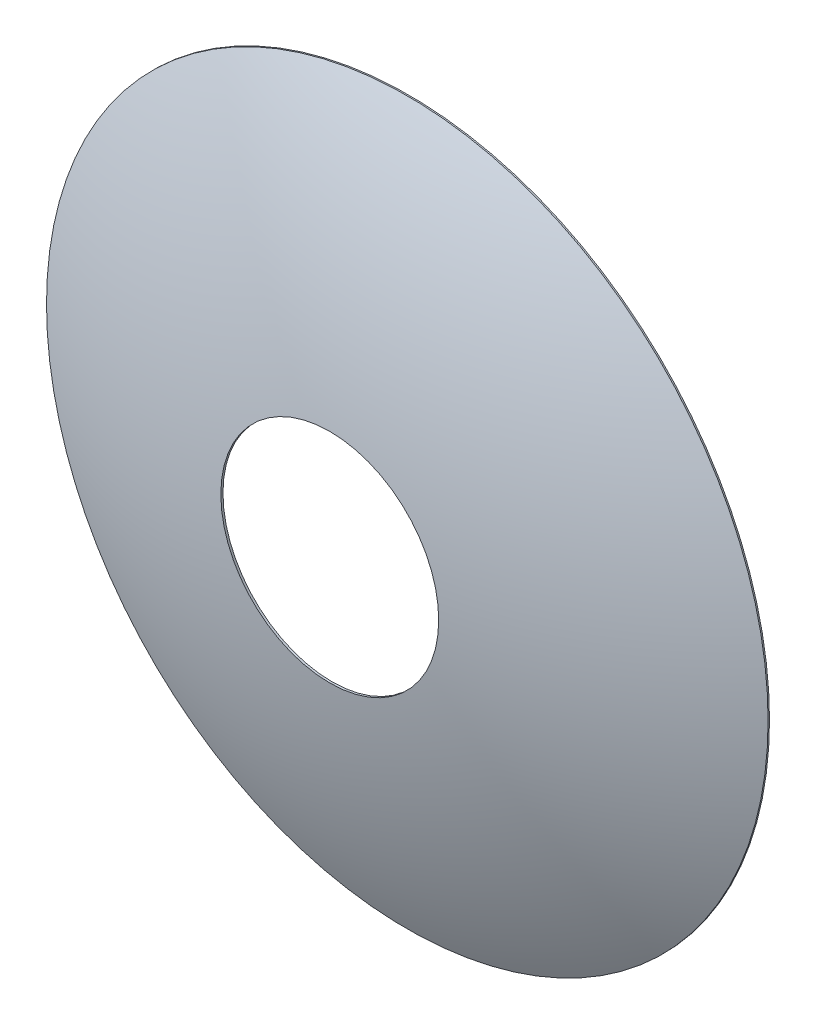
ISO-10303-21;
HEADER;
FILE_DESCRIPTION(('STEP AP214'),'2;1');
FILE_NAME('part.step','',(''),(''),'','','');
FILE_SCHEMA(('AUTOMOTIVE_DESIGN { 1 0 10303 214 1 1 1 1 }'));
ENDSEC;
DATA;
#1=APPLICATION_CONTEXT('core data for automotive mechanical design processes');
#2=APPLICATION_PROTOCOL_DEFINITION('international standard','automotive_design',2000,#1);
#3=PRODUCT_CONTEXT('',#1,'mechanical');
#4=PRODUCT('Part','Part','',(#3));
#5=PRODUCT_RELATED_PRODUCT_CATEGORY('part','',(#4));
#6=PRODUCT_DEFINITION_FORMATION('','',#4);
#7=PRODUCT_DEFINITION_CONTEXT('part definition',#1,'design');
#8=PRODUCT_DEFINITION('design','',#6,#7);
#9=PRODUCT_DEFINITION_SHAPE('','',#8);
#10=(LENGTH_UNIT() NAMED_UNIT(*) SI_UNIT(.MILLI.,.METRE.));
#11=(NAMED_UNIT(*) PLANE_ANGLE_UNIT() SI_UNIT($,.RADIAN.));
#12=(NAMED_UNIT(*) SI_UNIT($,.STERADIAN.) SOLID_ANGLE_UNIT());
#13=UNCERTAINTY_MEASURE_WITH_UNIT(LENGTH_MEASURE(1.E-05),#10,'distance_accuracy_value','');
#14=(GEOMETRIC_REPRESENTATION_CONTEXT(3) GLOBAL_UNCERTAINTY_ASSIGNED_CONTEXT((#13)) GLOBAL_UNIT_ASSIGNED_CONTEXT((#10,
#11,#12)) REPRESENTATION_CONTEXT('',''));
#15=CARTESIAN_POINT('',(0.,0.,0.));
#16=DIRECTION('',(0.,0.,1.));
#17=DIRECTION('',(1.,0.,0.));
#18=AXIS2_PLACEMENT_3D('',#15,#16,#17);
#19=CARTESIAN_POINT('',(0.,0.,-1023.75));
#20=DIRECTION('',(0.,0.,1.));
#21=DIRECTION('',(1.,0.,0.));
#22=AXIS2_PLACEMENT_3D('',#19,#20,#21);
#23=SPHERICAL_SURFACE('',#22,1143.75);
#24=CARTESIAN_POINT('',(0.,0.,0.));
#25=DIRECTION('',(0.,0.,1.));
#26=DIRECTION('',(1.,0.,0.));
#27=AXIS2_PLACEMENT_3D('',#24,#25,#26);
#28=CIRCLE('',#27,510.);
#29=CARTESIAN_POINT('',(510.,0.,0.));
#30=VERTEX_POINT('',#29);
#31=EDGE_CURVE('E43',#30,#30,#28,.T.);
#32=CARTESIAN_POINT('',(0.,0.,109.58492953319));
#33=DIRECTION('',(0.,0.,-1.));
#34=DIRECTION('',(-1.,0.,0.));
#35=AXIS2_PLACEMENT_3D('',#32,#33,#34);
#36=CIRCLE('',#35,154.);
#37=CARTESIAN_POINT('',(154.,0.,109.58492953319));
#38=VERTEX_POINT('',#37);
#39=EDGE_CURVE('E55',#38,#38,#36,.T.);
#40=CARTESIAN_POINT('',(510.,0.,0.));
#41=CARTESIAN_POINT('',(506.511504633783,0.,1.73785933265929));
#42=CARTESIAN_POINT('',(503.014125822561,0.,3.45788642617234));
#43=CARTESIAN_POINT('',(496.00196822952,0.,6.86209934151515));
#44=CARTESIAN_POINT('',(492.487189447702,0.,8.54628516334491));
#45=CARTESIAN_POINT('',(485.440598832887,0.,11.8786387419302));
#46=CARTESIAN_POINT('',(481.908786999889,0.,13.5268064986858));
#47=CARTESIAN_POINT('',(474.828499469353,0.,16.7869519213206));
#48=CARTESIAN_POINT('',(471.280023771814,0.,18.3989295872));
#49=CARTESIAN_POINT('',(464.166779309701,0.,21.5865263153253));
#50=CARTESIAN_POINT('',(460.602010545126,0.,23.1621453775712));
#51=CARTESIAN_POINT('',(453.456552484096,0.,26.2768602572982));
#52=CARTESIAN_POINT('',(449.87586318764,0.,27.8159560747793));
#53=CARTESIAN_POINT('',(442.698938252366,0.,30.8574636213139));
#54=CARTESIAN_POINT('',(439.102702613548,0.,32.3598753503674));
#55=CARTESIAN_POINT('',(431.895060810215,0.,35.3278577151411));
#56=CARTESIAN_POINT('',(428.283654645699,0.,36.7934283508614));
#57=CARTESIAN_POINT('',(421.046049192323,0.,39.6875753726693));
#58=CARTESIAN_POINT('',(417.419849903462,0.,41.1161517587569));
#59=CARTESIAN_POINT('',(410.153037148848,0.,43.9361609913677));
#60=CARTESIAN_POINT('',(406.512423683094,0.,45.3275938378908));
#61=CARTESIAN_POINT('',(399.217163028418,0.,48.0731705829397));
#62=CARTESIAN_POINT('',(395.562515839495,0.,49.4273144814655));
#63=CARTESIAN_POINT('',(388.23956965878,0.,52.0981718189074));
#64=CARTESIAN_POINT('',(384.571270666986,0.,53.4148852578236));
#65=CARTESIAN_POINT('',(377.221404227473,0.,56.010744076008));
#66=CARTESIAN_POINT('',(373.539836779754,0.,57.2898894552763));
#67=CARTESIAN_POINT('',(366.163818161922,0.,59.810478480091));
#68=CARTESIAN_POINT('',(362.469366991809,0.,61.0519221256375));
#69=CARTESIAN_POINT('',(355.067967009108,0.,63.4969779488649));
#70=CARTESIAN_POINT('',(351.36101819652,0.,64.7005901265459));
#71=CARTESIAN_POINT('',(343.93501031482,0.,67.0698572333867));
#72=CARTESIAN_POINT('',(340.215951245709,0.,68.2355121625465));
#73=CARTESIAN_POINT('',(332.766111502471,0.,70.5287429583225));
#74=CARTESIAN_POINT('',(329.035330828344,0.,71.6563188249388));
#75=CARTESIAN_POINT('',(321.562437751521,0.,73.873273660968));
#76=CARTESIAN_POINT('',(317.820325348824,0.,74.962652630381));
#77=CARTESIAN_POINT('',(310.325159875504,0.,77.1030998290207));
#78=CARTESIAN_POINT('',(306.572106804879,0.,78.1541680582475));
#79=CARTESIAN_POINT('',(299.055452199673,0.,80.2178839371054));
#80=CARTESIAN_POINT('',(295.29185066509,0.,81.2305315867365));
#81=CARTESIAN_POINT('',(287.754492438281,0.,83.2173004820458));
#82=CARTESIAN_POINT('',(283.980735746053,0.,84.191421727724));
#83=CARTESIAN_POINT('',(276.423461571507,0.,86.1010360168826));
#84=CARTESIAN_POINT('',(272.639944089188,0.,87.0365290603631));
#85=CARTESIAN_POINT('',(265.063543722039,0.,88.8687891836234));
#86=CARTESIAN_POINT('',(261.270660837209,0.,89.7655562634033));
#87=CARTESIAN_POINT('',(253.675926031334,0.,91.5202707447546));
#88=CARTESIAN_POINT('',(249.874074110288,0.,92.3782181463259));
#89=CARTESIAN_POINT('',(242.261798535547,0.,94.0552036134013));
#90=CARTESIAN_POINT('',(238.451374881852,0.,94.8742416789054));
#91=CARTESIAN_POINT('',(230.822354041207,0.,96.473322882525));
#92=CARTESIAN_POINT('',(227.003756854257,0.,97.2533660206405));
#93=CARTESIAN_POINT('',(219.358788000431,0.,98.7743758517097));
#94=CARTESIAN_POINT('',(215.532416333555,0.,99.5153425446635));
#95=CARTESIAN_POINT('',(207.872298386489,0.,100.958122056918));
#96=CARTESIAN_POINT('',(204.0385521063,0.,101.659934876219));
#97=CARTESIAN_POINT('',(196.364085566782,0.,103.024333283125));
#98=CARTESIAN_POINT('',(192.523365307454,0.,103.686918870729));
#99=CARTESIAN_POINT('',(184.835352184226,0.,104.972793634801));
#100=CARTESIAN_POINT('',(180.988059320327,0.,105.596082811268));
#101=CARTESIAN_POINT('',(173.287303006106,0.,106.803299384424));
#102=CARTESIAN_POINT('',(169.433839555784,0.,107.387226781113));
#103=CARTESIAN_POINT('',(161.721144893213,0.,108.515659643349));
#104=CARTESIAN_POINT('',(157.861913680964,0.,109.060165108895));
#105=CARTESIAN_POINT('',(154.,0.,109.58492953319));
#106=B_SPLINE_CURVE_WITH_KNOTS('',3,(#40,#41,#42,#43,#44,#45,#46,#47,#48,#49,#50,#51,#52,#53,
#54,#55,#56,#57,#58,#59,#60,#61,#62,#63,#64,#65,#66,#67,#68,#69,#70,#71,#72,#73,#74,#75,#76,#77,
#78,#79,#80,#81,#82,#83,#84,#85,#86,#87,#88,#89,#90,#91,#92,#93,#94,#95,#96,#97,#98,#99,#100,
#101,#102,#103,#104,#105),.UNSPECIFIED.,.F.,.F.,(4,2,2,2,2,2,2,2,2,2,2,2,2,2,2,2,2,2,2,2,2,2,2,
2,2,2,2,2,2,2,2,2,4),(0.,11.6921599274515,23.3843198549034,35.0764797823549,46.7686397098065,
58.4607996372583,70.1529595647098,81.8451194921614,93.5372794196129,105.229439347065,
116.921599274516,128.613759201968,140.30591912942,151.998079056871,163.690238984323,
175.382398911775,187.074558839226,198.766718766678,210.458878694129,222.151038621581,
233.843198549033,245.535358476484,257.227518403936,268.919678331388,280.611838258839,
292.303998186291,303.996158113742,315.688318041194,327.380477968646,339.072637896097,
350.764797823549,362.456957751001,374.149117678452),.UNSPECIFIED.);
#107=EDGE_CURVE('BSEAM36',#30,#38,#106,.T.);
#108=ORIENTED_EDGE('',*,*,#31,.T.);
#109=ORIENTED_EDGE('',*,*,#39,.T.);
#110=ORIENTED_EDGE('',*,*,#107,.T.);
#111=ORIENTED_EDGE('',*,*,#107,.F.);
#112=EDGE_LOOP('',(#108,#110,#109,#111));
#113=FACE_BOUND('',#112,.T.);
#114=ADVANCED_FACE('F36',(#113),#23,.T.);
#115=CARTESIAN_POINT('',(0.,0.,-1023.75));
#116=DIRECTION('',(0.,0.,1.));
#117=DIRECTION('',(1.,0.,0.));
#118=AXIS2_PLACEMENT_3D('',#115,#116,#117);
#119=SPHERICAL_SURFACE('',#118,1140.75);
#120=CARTESIAN_POINT('',(0.,0.,-1.8588304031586));
#121=DIRECTION('',(0.,0.,-1.));
#122=DIRECTION('',(-1.,0.,0.));
#123=AXIS2_PLACEMENT_3D('',#120,#121,#122);
#124=CIRCLE('',#123,507.);
#125=CARTESIAN_POINT('',(507.,0.,-1.85883040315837));
#126=VERTEX_POINT('',#125);
#127=EDGE_CURVE('E52',#126,#126,#124,.F.);
#128=CARTESIAN_POINT('',(0.,0.,106.557286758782));
#129=DIRECTION('',(0.,0.,-1.));
#130=DIRECTION('',(-1.,0.,0.));
#131=AXIS2_PLACEMENT_3D('',#128,#129,#130);
#132=CIRCLE('',#131,154.);
#133=CARTESIAN_POINT('',(154.000000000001,0.,106.557286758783));
#134=VERTEX_POINT('',#133);
#135=EDGE_CURVE('E39',#134,#134,#132,.T.);
#136=CARTESIAN_POINT('',(507.,0.,-1.85883040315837));
#137=CARTESIAN_POINT('',(503.538965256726,0.,-0.141675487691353));
#138=CARTESIAN_POINT('',(500.069206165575,0.,1.55789491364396));
#139=CARTESIAN_POINT('',(493.112598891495,0.,4.92169410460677));
#140=CARTESIAN_POINT('',(489.625750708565,0.,6.58592289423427));
#141=CARTESIAN_POINT('',(482.6353248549,0.,9.87886627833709));
#142=CARTESIAN_POINT('',(479.131747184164,0.,11.5075808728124));
#143=CARTESIAN_POINT('',(472.108224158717,0.,14.72932792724));
#144=CARTESIAN_POINT('',(468.588278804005,0.,16.3223603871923));
#145=CARTESIAN_POINT('',(461.532383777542,0.,19.4725786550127));
#146=CARTESIAN_POINT('',(457.996434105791,0.,21.0297644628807));
#147=CARTESIAN_POINT('',(450.908895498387,0.,24.1081286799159));
#148=CARTESIAN_POINT('',(447.357306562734,0.,25.6293070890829));
#149=CARTESIAN_POINT('',(440.238856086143,0.,28.6354994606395));
#150=CARTESIAN_POINT('',(436.671994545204,0.,30.1205134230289));
#151=CARTESIAN_POINT('',(429.523367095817,0.,33.0542235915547));
#152=CARTESIAN_POINT('',(425.941601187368,0.,34.5029197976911));
#153=CARTESIAN_POINT('',(418.763534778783,0.,37.3638448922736));
#154=CARTESIAN_POINT('',(415.167234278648,0.,38.7760737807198));
#155=CARTESIAN_POINT('',(407.960469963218,0.,41.5639184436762));
#156=CARTESIAN_POINT('',(404.350006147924,0.,42.9395342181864));
#157=CARTESIAN_POINT('',(397.115287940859,0.,45.6540106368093));
#158=CARTESIAN_POINT('',(393.491033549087,0.,46.992871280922));
#159=CARTESIAN_POINT('',(386.229108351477,0.,49.6336992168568));
#160=CARTESIAN_POINT('',(382.591437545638,0.,50.9356665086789));
#161=CARTESIAN_POINT('',(375.303055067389,0.,53.5025733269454));
#162=CARTESIAN_POINT('',(371.652343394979,0.,54.7675128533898));
#163=CARTESIAN_POINT('',(364.338256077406,0.,57.2602335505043));
#164=CARTESIAN_POINT('',(360.674880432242,0.,58.4880147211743));
#165=CARTESIAN_POINT('',(353.335843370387,0.,60.9062919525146));
#166=CARTESIAN_POINT('',(349.660181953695,0.,62.0967880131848));
#167=CARTESIAN_POINT('',(342.296952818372,0.,64.4403721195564));
#168=CARTESIAN_POINT('',(338.609385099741,0.,65.5934601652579));
#169=CARTESIAN_POINT('',(331.222724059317,0.,67.8621091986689));
#170=CARTESIAN_POINT('',(327.523630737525,0.,68.9776701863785));
#171=CARTESIAN_POINT('',(320.114300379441,0.,71.171149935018));
#172=CARTESIAN_POINT('',(316.40406334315,0.,72.2490686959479));
#173=CARTESIAN_POINT('',(308.972828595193,0.,74.3671527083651));
#174=CARTESIAN_POINT('',(305.251830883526,0.,75.4073179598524));
#175=CARTESIAN_POINT('',(297.799458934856,0.,77.449787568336));
#176=CARTESIAN_POINT('',(294.068084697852,0.,78.4520919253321));
#177=CARTESIAN_POINT('',(286.595344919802,0.,80.4187362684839));
#178=CARTESIAN_POINT('',(282.853979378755,0.,81.3830762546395));
#179=CARTESIAN_POINT('',(275.361643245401,0.,83.2736922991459));
#180=CARTESIAN_POINT('',(271.610672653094,0.,84.1999683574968));
#181=CARTESIAN_POINT('',(264.099513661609,0.,86.0143609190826));
#182=CARTESIAN_POINT('',(260.339325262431,0.,86.9024774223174));
#183=CARTESIAN_POINT('',(252.810118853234,0.,88.640459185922));
#184=CARTESIAN_POINT('',(249.041100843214,0.,89.4903244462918));
#185=CARTESIAN_POINT('',(241.494624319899,0.,91.1517159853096));
#186=CARTESIAN_POINT('',(237.717165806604,0.,91.9632422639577));
#187=CARTESIAN_POINT('',(230.154198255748,0.,93.5478720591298));
#188=CARTESIAN_POINT('',(226.368689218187,0.,94.3209755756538));
#189=CARTESIAN_POINT('',(218.790011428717,0.,95.8286800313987));
#190=CARTESIAN_POINT('',(214.996842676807,0.,96.5632809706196));
#191=CARTESIAN_POINT('',(207.403237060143,0.,97.9939044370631));
#192=CARTESIAN_POINT('',(203.602800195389,0.,98.6899269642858));
#193=CARTESIAN_POINT('',(195.99505070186,0.,100.043321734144));
#194=CARTESIAN_POINT('',(192.187738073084,0.,100.700693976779));
#195=CARTESIAN_POINT('',(184.56663012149,0.,101.976720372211));
#196=CARTESIAN_POINT('',(180.75283479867,0.,102.595374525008));
#197=CARTESIAN_POINT('',(173.119155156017,0.,103.793900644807));
#198=CARTESIAN_POINT('',(169.299270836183,0.,104.37377261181));
#199=CARTESIAN_POINT('',(161.653807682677,0.,105.494675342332));
#200=CARTESIAN_POINT('',(157.828228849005,0.,106.035706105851));
#201=CARTESIAN_POINT('',(154.000000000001,0.,106.557286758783));
#202=B_SPLINE_CURVE_WITH_KNOTS('',3,(#136,#137,#138,#139,#140,#141,#142,#143,#144,#145,#146,
#147,#148,#149,#150,#151,#152,#153,#154,#155,#156,#157,#158,#159,#160,#161,#162,#163,#164,#165,
#166,#167,#168,#169,#170,#171,#172,#173,#174,#175,#176,#177,#178,#179,#180,#181,#182,#183,#184,
#185,#186,#187,#188,#189,#190,#191,#192,#193,#194,#195,#196,#197,#198,#199,#200,#201),
.UNSPECIFIED.,.F.,.F.,(4,2,2,2,2,2,2,2,2,2,2,2,2,2,2,2,2,2,2,2,2,2,2,2,2,2,2,2,2,2,2,2,4),(0.,
11.5907413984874,23.1814827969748,34.7722241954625,46.3629655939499,57.9537069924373,
69.5444483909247,81.1351897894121,92.7259311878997,104.316672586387,115.907413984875,
127.498155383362,139.088896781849,150.679638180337,162.270379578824,173.861120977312,
185.451862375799,197.042603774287,208.633345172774,220.224086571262,231.814827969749,
243.405569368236,254.996310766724,266.587052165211,278.177793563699,289.768534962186,
301.359276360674,312.950017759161,324.540759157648,336.131500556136,347.722241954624,
359.312983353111,370.903724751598),.UNSPECIFIED.);
#203=EDGE_CURVE('BSEAM64',#126,#134,#202,.T.);
#204=ORIENTED_EDGE('',*,*,#127,.F.);
#205=ORIENTED_EDGE('',*,*,#135,.F.);
#206=ORIENTED_EDGE('',*,*,#203,.T.);
#207=ORIENTED_EDGE('',*,*,#203,.F.);
#208=EDGE_LOOP('',(#204,#206,#205,#207));
#209=FACE_BOUND('',#208,.T.);
#210=ADVANCED_FACE('F64',(#209),#119,.F.);
#211=CARTESIAN_POINT('',(0.,0.,-2.));
#212=DIRECTION('',(0.,0.,1.));
#213=DIRECTION('',(1.,0.,0.));
#214=AXIS2_PLACEMENT_3D('',#211,#212,#213);
#215=CYLINDRICAL_SURFACE('',#214,510.);
#216=CARTESIAN_POINT('',(0.,0.,-2.));
#217=DIRECTION('',(0.,0.,1.));
#218=DIRECTION('',(1.,0.,0.));
#219=AXIS2_PLACEMENT_3D('',#216,#217,#218);
#220=CIRCLE('',#219,510.);
#221=CARTESIAN_POINT('',(510.,0.,-2.));
#222=VERTEX_POINT('',#221);
#223=EDGE_CURVE('E10',#222,#222,#220,.T.);
#224=ORIENTED_EDGE('',*,*,#223,.T.);
#225=EDGE_LOOP('',(#224));
#226=FACE_BOUND('',#225,.T.);
#227=ORIENTED_EDGE('',*,*,#31,.F.);
#228=EDGE_LOOP('',(#227));
#229=FACE_BOUND('',#228,.T.);
#230=ADVANCED_FACE('F66',(#226,#229),#215,.T.);
#231=CARTESIAN_POINT('',(0.,0.,-2.));
#232=DIRECTION('',(0.,0.,1.));
#233=DIRECTION('',(1.,0.,0.));
#234=AXIS2_PLACEMENT_3D('',#231,#232,#233);
#235=PLANE('',#234);
#236=CARTESIAN_POINT('',(0.,0.,-2.));
#237=DIRECTION('',(0.,0.,1.));
#238=DIRECTION('',(1.,0.,0.));
#239=AXIS2_PLACEMENT_3D('',#236,#237,#238);
#240=CIRCLE('',#239,507.);
#241=CARTESIAN_POINT('',(507.,0.,-2.));
#242=VERTEX_POINT('',#241);
#243=EDGE_CURVE('E48',#242,#242,#240,.T.);
#244=ORIENTED_EDGE('',*,*,#243,.T.);
#245=EDGE_LOOP('',(#244));
#246=FACE_BOUND('',#245,.T.);
#247=ORIENTED_EDGE('',*,*,#223,.F.);
#248=EDGE_LOOP('',(#247));
#249=FACE_BOUND('',#248,.T.);
#250=ADVANCED_FACE('F73',(#246,#249),#235,.F.);
#251=CARTESIAN_POINT('',(0.,0.,-2.));
#252=DIRECTION('',(0.,0.,1.));
#253=DIRECTION('',(1.,0.,0.));
#254=AXIS2_PLACEMENT_3D('',#251,#252,#253);
#255=CYLINDRICAL_SURFACE('',#254,507.);
#256=ORIENTED_EDGE('',*,*,#243,.F.);
#257=EDGE_LOOP('',(#256));
#258=FACE_BOUND('',#257,.T.);
#259=ORIENTED_EDGE('',*,*,#127,.T.);
#260=EDGE_LOOP('',(#259));
#261=FACE_BOUND('',#260,.T.);
#262=ADVANCED_FACE('F78',(#258,#261),#255,.F.);
#263=CARTESIAN_POINT('',(0.,0.,537.));
#264=DIRECTION('',(0.,0.,-1.));
#265=DIRECTION('',(-1.,0.,0.));
#266=AXIS2_PLACEMENT_3D('',#263,#264,#265);
#267=CYLINDRICAL_SURFACE('',#266,154.);
#268=ORIENTED_EDGE('',*,*,#39,.F.);
#269=EDGE_LOOP('',(#268));
#270=FACE_BOUND('',#269,.T.);
#271=ORIENTED_EDGE('',*,*,#135,.T.);
#272=EDGE_LOOP('',(#271));
#273=FACE_BOUND('',#272,.T.);
#274=ADVANCED_FACE('F62',(#270,#273),#267,.F.);
#275=CLOSED_SHELL('',(#114,#210,#230,#250,#262,#274));
#276=MANIFOLD_SOLID_BREP('B2',#275);
#277=ADVANCED_BREP_SHAPE_REPRESENTATION('',(#18,#276),#14);
#278=SHAPE_DEFINITION_REPRESENTATION(#9,#277);
ENDSEC;
END-ISO-10303-21;
